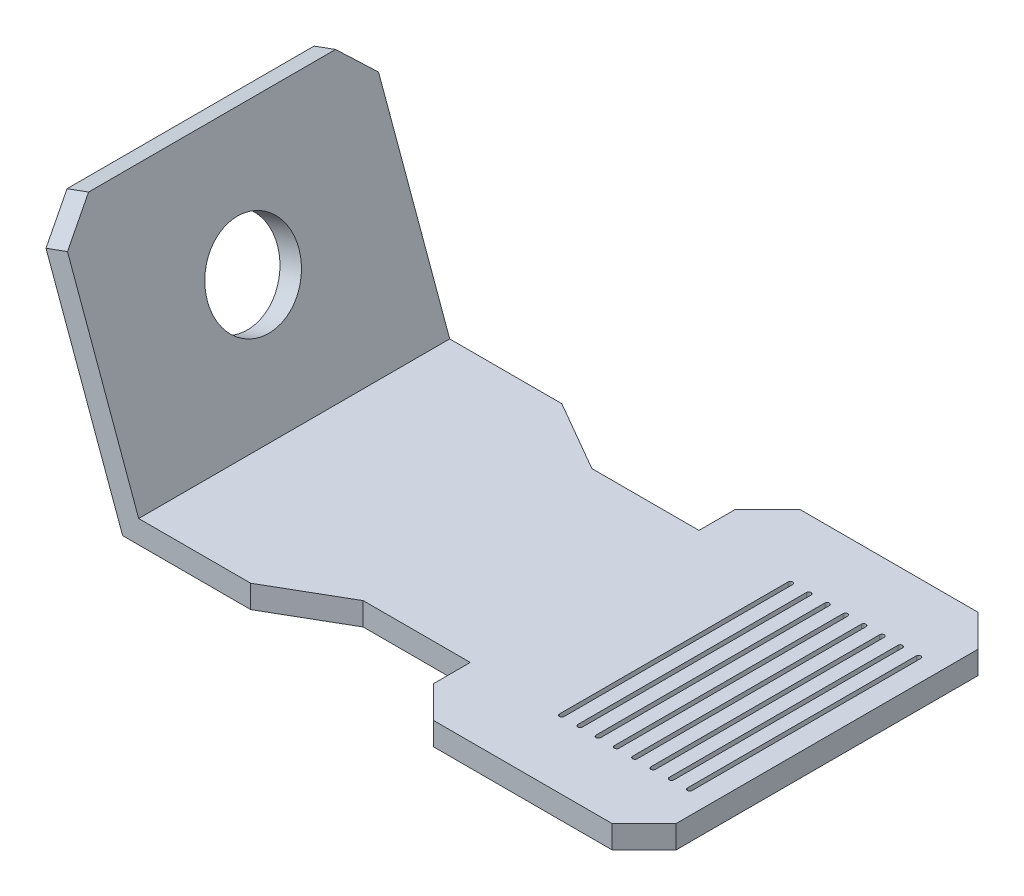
from build123d import *

# Parameters (mm, degrees)
BOSS_EXTRUDE1_DEPTH             = 5
BOSS_EXTRUDE2_REACH             = 128.59
BOSS_EXTRUDE2_DIRECTION_2_REACH = 128.59
CUT_EXTRUDE1_DEPTH              = 153.961847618
LPATTERN1_COUNT                 = 8
LPATTERN1_PITCH                 = 4
CUT_EXTRUDE2_REACH              = 144.021
SKETCH5_R                       = 10
CHAMFER1_SIZE                   = 7


with BuildPart() as part:
    # Sketch2 → Boss-Extrude1 (new body)
    with BuildSketch(Plane(origin=(0, 0, 0), x_dir=(1, 0, 0), z_dir=(0, 1, 0))):
        Polygon((0, -40), (0, 40), (-53, 40), (-53, 25), (-76.411542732, 25), (-92, 34), (-120, 34), (-120, -34), (-92, -34), (-76.411542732, -25), (-53, -25), (-53, -40), align=None)
    extrude(amount=BOSS_EXTRUDE1_DEPTH)

    # Boss-Extrude2: up to this face of the body (flat: up to its plane)
    boss_extrude2_end = Plane(part.part.faces().sort_by_distance((-106, 2.5, 34))[0])
    # Sketch3 → Boss-Extrude2 (add, up to the picked face)
    with BuildSketch(Plane.XY, mode=Mode.PRIVATE) as boss_extrude2_sk1:
        Polygon((-120, 0), (-139.153128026, 52.622786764), (-134.454664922, 54.332887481), (-115.301536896, 1.710100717), align=None)
    boss_extrude2_tool1 = split(extrude(boss_extrude2_sk1.sketch, amount=BOSS_EXTRUDE2_REACH, mode=Mode.PRIVATE), bisect_by=boss_extrude2_end, keep=Keep.BOTH, mode=Mode.PRIVATE)
    add(boss_extrude2_tool1.solids().sort_by(Axis((-127.227332, 27.166444, 0), (0, 0, 1)))[0])

    # Boss-Extrude2 direction 2: up to this face of the body (flat: up to its plane)
    boss_extrude2_direction_2_end = Plane(part.part.faces().sort_by_distance((-106, 2.5, -34))[0])
    # Sketch3 → Boss-Extrude2 direction 2 (add, up to the picked face)
    with BuildSketch(Plane.XY, mode=Mode.PRIVATE) as boss_extrude2_direction_2_sk1:
        Polygon((-120, 0), (-139.153128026, 52.622786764), (-134.454664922, 54.332887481), (-115.301536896, 1.710100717), align=None)
    boss_extrude2_direction_2_tool1 = split(extrude(boss_extrude2_direction_2_sk1.sketch, amount=-BOSS_EXTRUDE2_DIRECTION_2_REACH, mode=Mode.PRIVATE), bisect_by=boss_extrude2_direction_2_end, keep=Keep.BOTH, mode=Mode.PRIVATE)
    add(boss_extrude2_direction_2_tool1.solids().sort_by(Axis((-127.227332, 27.166444, 0), (0, 0, -1)))[0])

    # Sketch4 → Cut-Extrude1 (cut, through all)
    with BuildSketch(Plane(origin=(0, 5, 0), x_dir=(1, 0, 0), z_dir=(0, 1, 0))):
        with BuildLine():
            Line((-5.5, -25), (-5.5, 25))
            ThreePointArc((-5.5, 25), (-5, 25.5), (-4.5, 25))
            Line((-4.5, 25), (-4.5, -25))
            ThreePointArc((-4.5, -25), (-5, -25.5), (-5.5, -25))
        make_face()
    cut_extrude1 = extrude(amount=-CUT_EXTRUDE1_DEPTH, mode=Mode.SUBTRACT)

    # LPattern1: Cut-Extrude1 ×8
    with Locations(*[(-i * LPATTERN1_PITCH, 0, 0) for i in range(1, LPATTERN1_COUNT)]):
        add(cut_extrude1, mode=Mode.SUBTRACT)

    # Sketch5 → Cut-Extrude2 (cut, up to next)
    with BuildSketch(Plane(origin=(-101.264203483, -36.857155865, 0), x_dir=(0, 0, -1), z_dir=(0.9396926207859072, 0.3420201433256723, 0)), mode=Mode.PRIVATE) as cut_extrude2_sk1:
        with Locations(Location((0, 70.792936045, 0), (0, 0, 90))):
            Circle(SKETCH5_R)
    cut_extrude2_tool1 = extrude(cut_extrude2_sk1.sketch, amount=-CUT_EXTRUDE2_REACH, mode=Mode.PRIVATE) & part.part
    add(cut_extrude2_tool1.solids().sort_by_distance((-125.476814, 29.666444, 0))[0], mode=Mode.SUBTRACT)

    # Chamfer1
    chamfer1_edges = [part.edges().sort_by_distance(p)[0] for p in [
        (-53, 2.5, 40),
        (-53, 2.5, -40),
        (0, 2.5, -40),
        (0, 2.5, 40),
        (-136.803896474, 53.477837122, -34),
        (-136.803896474, 53.477837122, 34),
    ]]
    chamfer(chamfer1_edges, length=CHAMFER1_SIZE)


solid = part.part
